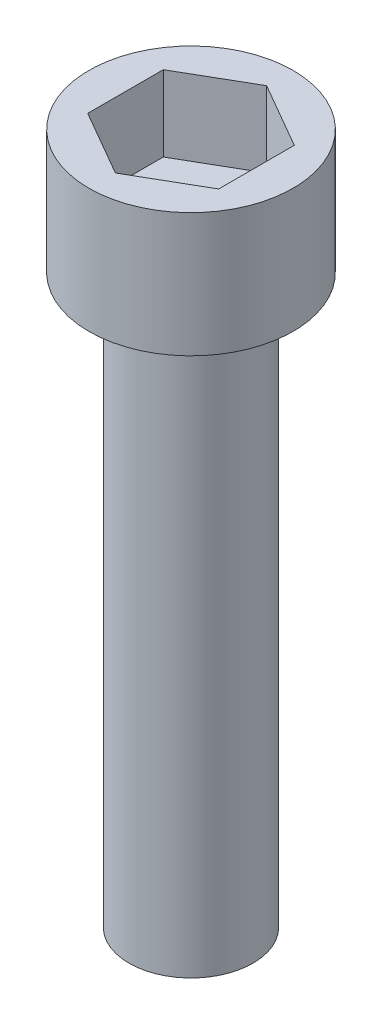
from build123d import *

# Parameters (mm, degrees)
CUT_EXTRUDE1_DEPTH = 2.54


with BuildPart() as part:
    # Sketch1 → Revolve1 (revolve)
    with BuildSketch(Plane.XY, mode=Mode.PRIVATE) as revolve1_sk:
        Polygon((0, 0), (-3.429, 0), (-3.429, -4.1656), (-2.0828, -4.1656), (-2.0828, -23.2156), (0, -23.2156), align=None)
    revolve(revolve1_sk.sketch.rotate(Axis((0, 66.04, 0), (0, -1, 0)), 270), axis=Axis((0, 66.04, 0), (0, -1, 0)))

    # Sketch2 → Cut-Extrude1 (cut)
    with BuildSketch(Plane(origin=(0, 0, 0), x_dir=(-1, 0, 0), z_dir=(0, 1, 0))):
        Polygon((0, -2.54), (2.199704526, -1.27), (2.199704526, 1.27), (0, 2.54), (-2.199704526, 1.27), (-2.199704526, -1.27), align=None)
    extrude(amount=-CUT_EXTRUDE1_DEPTH, mode=Mode.SUBTRACT)


solid = part.part
